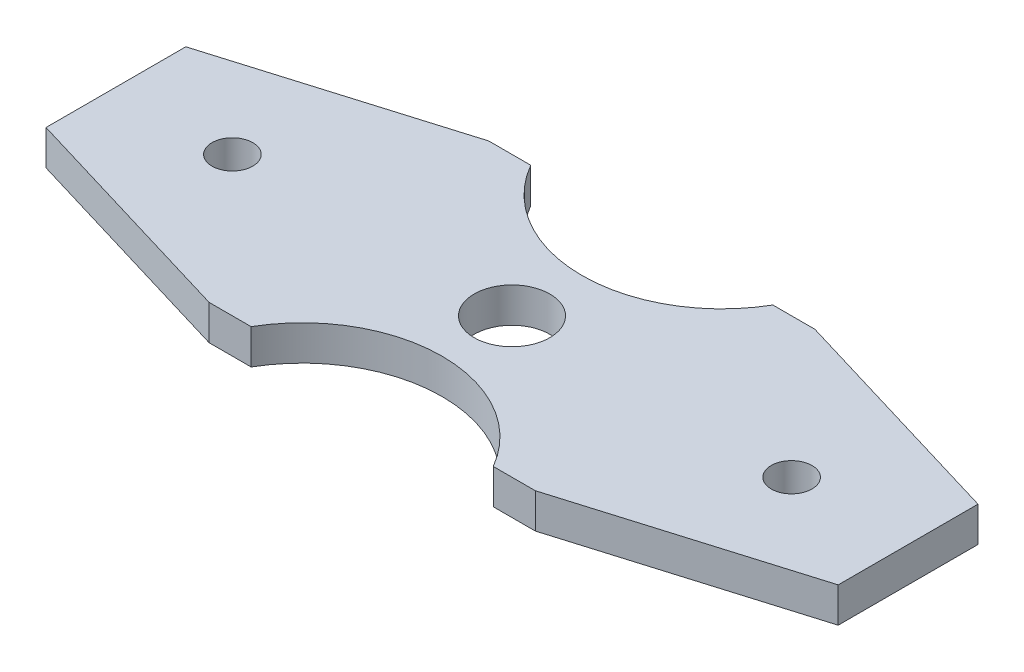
ISO-10303-21;
HEADER;
FILE_DESCRIPTION(('STEP AP214'),'2;1');
FILE_NAME('part.step','',(''),(''),'','','');
FILE_SCHEMA(('AUTOMOTIVE_DESIGN { 1 0 10303 214 1 1 1 1 }'));
ENDSEC;
DATA;
#1=APPLICATION_CONTEXT('core data for automotive mechanical design processes');
#2=APPLICATION_PROTOCOL_DEFINITION('international standard','automotive_design',2000,#1);
#3=PRODUCT_CONTEXT('',#1,'mechanical');
#4=PRODUCT('Part','Part','',(#3));
#5=PRODUCT_RELATED_PRODUCT_CATEGORY('part','',(#4));
#6=PRODUCT_DEFINITION_FORMATION('','',#4);
#7=PRODUCT_DEFINITION_CONTEXT('part definition',#1,'design');
#8=PRODUCT_DEFINITION('design','',#6,#7);
#9=PRODUCT_DEFINITION_SHAPE('','',#8);
#10=(LENGTH_UNIT() NAMED_UNIT(*) SI_UNIT(.MILLI.,.METRE.));
#11=(NAMED_UNIT(*) PLANE_ANGLE_UNIT() SI_UNIT($,.RADIAN.));
#12=(NAMED_UNIT(*) SI_UNIT($,.STERADIAN.) SOLID_ANGLE_UNIT());
#13=UNCERTAINTY_MEASURE_WITH_UNIT(LENGTH_MEASURE(1.E-05),#10,'distance_accuracy_value','');
#14=(GEOMETRIC_REPRESENTATION_CONTEXT(3) GLOBAL_UNCERTAINTY_ASSIGNED_CONTEXT((#13)) GLOBAL_UNIT_ASSIGNED_CONTEXT((#10,
#11,#12)) REPRESENTATION_CONTEXT('',''));
#15=CARTESIAN_POINT('',(0.,0.,0.));
#16=DIRECTION('',(0.,0.,1.));
#17=DIRECTION('',(1.,0.,0.));
#18=AXIS2_PLACEMENT_3D('',#15,#16,#17);
#19=CARTESIAN_POINT('',(34.,3.,5.99999999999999));
#20=DIRECTION('',(0.,1.,0.));
#21=DIRECTION('',(0.,0.,1.));
#22=AXIS2_PLACEMENT_3D('',#19,#20,#21);
#23=PLANE('',#22);
#24=CARTESIAN_POINT('',(10.,3.,-12.));
#25=DIRECTION('',(0.,1.,0.));
#26=DIRECTION('',(0.,0.,1.));
#27=AXIS2_PLACEMENT_3D('',#24,#25,#26);
#28=CIRCLE('',#27,1.75);
#29=CARTESIAN_POINT('',(10.,3.,-10.25));
#30=VERTEX_POINT('',#29);
#31=EDGE_CURVE('E303',#30,#30,#28,.T.);
#32=ORIENTED_EDGE('',*,*,#31,.F.);
#33=EDGE_LOOP('',(#32));
#34=FACE_BOUND('',#33,.T.);
#35=CARTESIAN_POINT('',(34.,3.,5.99999999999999));
#36=DIRECTION('',(0.,-1.,0.));
#37=DIRECTION('',(0.,0.,1.));
#38=AXIS2_PLACEMENT_3D('',#35,#36,#37);
#39=CIRCLE('',#38,12.);
#40=CARTESIAN_POINT('',(23.6076951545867,3.,0.));
#41=VERTEX_POINT('',#40);
#42=CARTESIAN_POINT('',(44.3923048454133,3.,0.));
#43=VERTEX_POINT('',#42);
#44=EDGE_CURVE('E168',#41,#43,#39,.T.);
#45=ORIENTED_EDGE('',*,*,#44,.T.);
#46=DIRECTION('',(1.,0.,0.));
#47=VECTOR('',#46,1.);
#48=CARTESIAN_POINT('',(44.3923048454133,3.,0.));
#49=LINE('',#48,#47);
#50=CARTESIAN_POINT('',(48.,3.,0.));
#51=VERTEX_POINT('',#50);
#52=EDGE_CURVE('E137',#43,#51,#49,.T.);
#53=ORIENTED_EDGE('',*,*,#52,.T.);
#54=DIRECTION('',(0.957826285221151,0.,-0.287347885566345));
#55=VECTOR('',#54,1.);
#56=CARTESIAN_POINT('',(68.,3.,-6.));
#57=LINE('',#56,#55);
#58=CARTESIAN_POINT('',(68.,3.,-6.));
#59=VERTEX_POINT('',#58);
#60=EDGE_CURVE('E171',#51,#59,#57,.T.);
#61=ORIENTED_EDGE('',*,*,#60,.T.);
#62=DIRECTION('',(0.,0.,-1.));
#63=VECTOR('',#62,1.);
#64=CARTESIAN_POINT('',(68.,3.,-6.));
#65=LINE('',#64,#63);
#66=CARTESIAN_POINT('',(68.,3.,-18.));
#67=VERTEX_POINT('',#66);
#68=EDGE_CURVE('E173',#59,#67,#65,.T.);
#69=ORIENTED_EDGE('',*,*,#68,.T.);
#70=DIRECTION('',(-0.957826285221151,0.,-0.287347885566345));
#71=VECTOR('',#70,1.);
#72=CARTESIAN_POINT('',(68.,3.,-18.));
#73=LINE('',#72,#71);
#74=CARTESIAN_POINT('',(48.,3.,-24.));
#75=VERTEX_POINT('',#74);
#76=EDGE_CURVE('E175',#67,#75,#73,.T.);
#77=ORIENTED_EDGE('',*,*,#76,.T.);
#78=DIRECTION('',(-1.,0.,0.));
#79=VECTOR('',#78,1.);
#80=CARTESIAN_POINT('',(44.3923048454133,3.,-24.));
#81=LINE('',#80,#79);
#82=CARTESIAN_POINT('',(44.3923048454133,3.,-24.));
#83=VERTEX_POINT('',#82);
#84=EDGE_CURVE('E177',#75,#83,#81,.T.);
#85=ORIENTED_EDGE('',*,*,#84,.T.);
#86=CARTESIAN_POINT('',(34.,3.,-30.));
#87=DIRECTION('',(0.,-1.,0.));
#88=DIRECTION('',(0.,0.,1.));
#89=AXIS2_PLACEMENT_3D('',#86,#87,#88);
#90=CIRCLE('',#89,12.);
#91=CARTESIAN_POINT('',(23.6076951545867,3.,-24.));
#92=VERTEX_POINT('',#91);
#93=EDGE_CURVE('E179',#83,#92,#90,.T.);
#94=ORIENTED_EDGE('',*,*,#93,.T.);
#95=DIRECTION('',(-1.,0.,0.));
#96=VECTOR('',#95,1.);
#97=CARTESIAN_POINT('',(20.,3.,-24.));
#98=LINE('',#97,#96);
#99=CARTESIAN_POINT('',(20.,3.,-24.));
#100=VERTEX_POINT('',#99);
#101=EDGE_CURVE('E181',#92,#100,#98,.T.);
#102=ORIENTED_EDGE('',*,*,#101,.T.);
#103=DIRECTION('',(-0.957826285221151,0.,0.287347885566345));
#104=VECTOR('',#103,1.);
#105=CARTESIAN_POINT('',(0.,3.,-18.));
#106=LINE('',#105,#104);
#107=CARTESIAN_POINT('',(0.,3.,-18.));
#108=VERTEX_POINT('',#107);
#109=EDGE_CURVE('E183',#100,#108,#106,.T.);
#110=ORIENTED_EDGE('',*,*,#109,.T.);
#111=DIRECTION('',(0.,0.,1.));
#112=VECTOR('',#111,1.);
#113=CARTESIAN_POINT('',(0.,3.,-6.));
#114=LINE('',#113,#112);
#115=CARTESIAN_POINT('',(0.,3.,-6.));
#116=VERTEX_POINT('',#115);
#117=EDGE_CURVE('E185',#108,#116,#114,.T.);
#118=ORIENTED_EDGE('',*,*,#117,.T.);
#119=DIRECTION('',(0.957826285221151,0.,0.287347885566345));
#120=VECTOR('',#119,1.);
#121=CARTESIAN_POINT('',(0.,3.,-6.));
#122=LINE('',#121,#120);
#123=CARTESIAN_POINT('',(20.,3.,0.));
#124=VERTEX_POINT('',#123);
#125=EDGE_CURVE('E54',#116,#124,#122,.T.);
#126=ORIENTED_EDGE('',*,*,#125,.T.);
#127=DIRECTION('',(1.,0.,0.));
#128=VECTOR('',#127,1.);
#129=CARTESIAN_POINT('',(20.,3.,0.));
#130=LINE('',#129,#128);
#131=EDGE_CURVE('E49',#124,#41,#130,.T.);
#132=ORIENTED_EDGE('',*,*,#131,.T.);
#133=EDGE_LOOP('',(#45,#53,#61,#69,#77,#85,#94,#102,#110,#118,#126,#132));
#134=FACE_BOUND('',#133,.T.);
#135=CARTESIAN_POINT('',(34.,3.,-12.));
#136=DIRECTION('',(0.,1.,0.));
#137=DIRECTION('',(0.,0.,1.));
#138=AXIS2_PLACEMENT_3D('',#135,#136,#137);
#139=CIRCLE('',#138,3.25);
#140=CARTESIAN_POINT('',(34.,3.,-8.75));
#141=VERTEX_POINT('',#140);
#142=EDGE_CURVE('E142',#141,#141,#139,.T.);
#143=ORIENTED_EDGE('',*,*,#142,.F.);
#144=EDGE_LOOP('',(#143));
#145=FACE_BOUND('',#144,.T.);
#146=CARTESIAN_POINT('',(58.,3.,-12.));
#147=DIRECTION('',(0.,1.,0.));
#148=DIRECTION('',(0.,0.,1.));
#149=AXIS2_PLACEMENT_3D('',#146,#147,#148);
#150=CIRCLE('',#149,1.75);
#151=CARTESIAN_POINT('',(58.,3.,-10.25));
#152=VERTEX_POINT('',#151);
#153=EDGE_CURVE('E292',#152,#152,#150,.T.);
#154=ORIENTED_EDGE('',*,*,#153,.F.);
#155=EDGE_LOOP('',(#154));
#156=FACE_BOUND('',#155,.T.);
#157=ADVANCED_FACE('F34',(#34,#134,#145,#156),#23,.T.);
#158=CARTESIAN_POINT('',(34.,0.,5.99999999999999));
#159=DIRECTION('',(0.,1.,0.));
#160=DIRECTION('',(0.,0.,1.));
#161=AXIS2_PLACEMENT_3D('',#158,#159,#160);
#162=PLANE('',#161);
#163=CARTESIAN_POINT('',(10.,0.,-12.));
#164=DIRECTION('',(0.,1.,0.));
#165=DIRECTION('',(0.,0.,1.));
#166=AXIS2_PLACEMENT_3D('',#163,#164,#165);
#167=CIRCLE('',#166,1.75);
#168=CARTESIAN_POINT('',(10.,0.,-10.25));
#169=VERTEX_POINT('',#168);
#170=EDGE_CURVE('E298',#169,#169,#167,.T.);
#171=ORIENTED_EDGE('',*,*,#170,.T.);
#172=EDGE_LOOP('',(#171));
#173=FACE_BOUND('',#172,.T.);
#174=CARTESIAN_POINT('',(34.,0.,5.99999999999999));
#175=DIRECTION('',(0.,-1.,0.));
#176=DIRECTION('',(0.,0.,1.));
#177=AXIS2_PLACEMENT_3D('',#174,#175,#176);
#178=CIRCLE('',#177,12.);
#179=CARTESIAN_POINT('',(23.6076951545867,0.,0.));
#180=VERTEX_POINT('',#179);
#181=CARTESIAN_POINT('',(44.3923048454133,0.,0.));
#182=VERTEX_POINT('',#181);
#183=EDGE_CURVE('E128',#180,#182,#178,.T.);
#184=ORIENTED_EDGE('',*,*,#183,.F.);
#185=DIRECTION('',(1.,0.,0.));
#186=VECTOR('',#185,1.);
#187=CARTESIAN_POINT('',(20.,0.,0.));
#188=LINE('',#187,#186);
#189=CARTESIAN_POINT('',(20.,0.,0.));
#190=VERTEX_POINT('',#189);
#191=EDGE_CURVE('E166',#190,#180,#188,.T.);
#192=ORIENTED_EDGE('',*,*,#191,.F.);
#193=DIRECTION('',(0.957826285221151,0.,0.287347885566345));
#194=VECTOR('',#193,1.);
#195=CARTESIAN_POINT('',(0.,0.,-6.));
#196=LINE('',#195,#194);
#197=CARTESIAN_POINT('',(0.,0.,-6.));
#198=VERTEX_POINT('',#197);
#199=EDGE_CURVE('E164',#198,#190,#196,.T.);
#200=ORIENTED_EDGE('',*,*,#199,.F.);
#201=DIRECTION('',(0.,0.,1.));
#202=VECTOR('',#201,1.);
#203=CARTESIAN_POINT('',(0.,0.,-6.));
#204=LINE('',#203,#202);
#205=CARTESIAN_POINT('',(0.,0.,-18.));
#206=VERTEX_POINT('',#205);
#207=EDGE_CURVE('E162',#206,#198,#204,.T.);
#208=ORIENTED_EDGE('',*,*,#207,.F.);
#209=DIRECTION('',(-0.957826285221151,0.,0.287347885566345));
#210=VECTOR('',#209,1.);
#211=CARTESIAN_POINT('',(0.,0.,-18.));
#212=LINE('',#211,#210);
#213=CARTESIAN_POINT('',(20.,0.,-24.));
#214=VERTEX_POINT('',#213);
#215=EDGE_CURVE('E160',#214,#206,#212,.T.);
#216=ORIENTED_EDGE('',*,*,#215,.F.);
#217=DIRECTION('',(-1.,0.,0.));
#218=VECTOR('',#217,1.);
#219=CARTESIAN_POINT('',(20.,0.,-24.));
#220=LINE('',#219,#218);
#221=CARTESIAN_POINT('',(23.6076951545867,0.,-24.));
#222=VERTEX_POINT('',#221);
#223=EDGE_CURVE('E158',#222,#214,#220,.T.);
#224=ORIENTED_EDGE('',*,*,#223,.F.);
#225=CARTESIAN_POINT('',(34.,0.,-30.));
#226=DIRECTION('',(0.,-1.,0.));
#227=DIRECTION('',(0.,0.,1.));
#228=AXIS2_PLACEMENT_3D('',#225,#226,#227);
#229=CIRCLE('',#228,12.);
#230=CARTESIAN_POINT('',(44.3923048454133,0.,-24.));
#231=VERTEX_POINT('',#230);
#232=EDGE_CURVE('E156',#231,#222,#229,.T.);
#233=ORIENTED_EDGE('',*,*,#232,.F.);
#234=DIRECTION('',(-1.,0.,0.));
#235=VECTOR('',#234,1.);
#236=CARTESIAN_POINT('',(44.3923048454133,0.,-24.));
#237=LINE('',#236,#235);
#238=CARTESIAN_POINT('',(48.,0.,-24.));
#239=VERTEX_POINT('',#238);
#240=EDGE_CURVE('E154',#239,#231,#237,.T.);
#241=ORIENTED_EDGE('',*,*,#240,.F.);
#242=DIRECTION('',(-0.957826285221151,0.,-0.287347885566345));
#243=VECTOR('',#242,1.);
#244=CARTESIAN_POINT('',(68.,0.,-18.));
#245=LINE('',#244,#243);
#246=CARTESIAN_POINT('',(68.,0.,-18.));
#247=VERTEX_POINT('',#246);
#248=EDGE_CURVE('E152',#247,#239,#245,.T.);
#249=ORIENTED_EDGE('',*,*,#248,.F.);
#250=DIRECTION('',(0.,0.,-1.));
#251=VECTOR('',#250,1.);
#252=CARTESIAN_POINT('',(68.,0.,-6.));
#253=LINE('',#252,#251);
#254=CARTESIAN_POINT('',(68.,0.,-6.));
#255=VERTEX_POINT('',#254);
#256=EDGE_CURVE('E150',#255,#247,#253,.T.);
#257=ORIENTED_EDGE('',*,*,#256,.F.);
#258=DIRECTION('',(0.957826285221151,0.,-0.287347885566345));
#259=VECTOR('',#258,1.);
#260=CARTESIAN_POINT('',(68.,0.,-6.));
#261=LINE('',#260,#259);
#262=CARTESIAN_POINT('',(48.,0.,0.));
#263=VERTEX_POINT('',#262);
#264=EDGE_CURVE('E130',#263,#255,#261,.T.);
#265=ORIENTED_EDGE('',*,*,#264,.F.);
#266=DIRECTION('',(1.,0.,0.));
#267=VECTOR('',#266,1.);
#268=CARTESIAN_POINT('',(44.3923048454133,0.,0.));
#269=LINE('',#268,#267);
#270=EDGE_CURVE('E123',#182,#263,#269,.T.);
#271=ORIENTED_EDGE('',*,*,#270,.F.);
#272=EDGE_LOOP('',(#184,#192,#200,#208,#216,#224,#233,#241,#249,#257,#265,#271));
#273=FACE_BOUND('',#272,.T.);
#274=CARTESIAN_POINT('',(34.,0.,-12.));
#275=DIRECTION('',(0.,1.,0.));
#276=DIRECTION('',(0.,0.,1.));
#277=AXIS2_PLACEMENT_3D('',#274,#275,#276);
#278=CIRCLE('',#277,3.25);
#279=CARTESIAN_POINT('',(34.,0.,-8.75));
#280=VERTEX_POINT('',#279);
#281=EDGE_CURVE('E145',#280,#280,#278,.T.);
#282=ORIENTED_EDGE('',*,*,#281,.T.);
#283=EDGE_LOOP('',(#282));
#284=FACE_BOUND('',#283,.T.);
#285=CARTESIAN_POINT('',(58.,0.,-12.));
#286=DIRECTION('',(0.,1.,0.));
#287=DIRECTION('',(0.,0.,1.));
#288=AXIS2_PLACEMENT_3D('',#285,#286,#287);
#289=CIRCLE('',#288,1.75);
#290=CARTESIAN_POINT('',(58.,0.,-10.25));
#291=VERTEX_POINT('',#290);
#292=EDGE_CURVE('E295',#291,#291,#289,.T.);
#293=ORIENTED_EDGE('',*,*,#292,.T.);
#294=EDGE_LOOP('',(#293));
#295=FACE_BOUND('',#294,.T.);
#296=ADVANCED_FACE('F124',(#173,#273,#284,#295),#162,.F.);
#297=CARTESIAN_POINT('',(34.,3.,5.99999999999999));
#298=DIRECTION('',(0.,-1.,0.));
#299=DIRECTION('',(0.,0.,-1.));
#300=AXIS2_PLACEMENT_3D('',#297,#298,#299);
#301=CYLINDRICAL_SURFACE('',#300,12.);
#302=ORIENTED_EDGE('',*,*,#183,.T.);
#303=DIRECTION('',(0.,-1.,0.));
#304=VECTOR('',#303,1.);
#305=CARTESIAN_POINT('',(44.3923048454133,3.,0.));
#306=LINE('',#305,#304);
#307=EDGE_CURVE('E11',#43,#182,#306,.T.);
#308=ORIENTED_EDGE('',*,*,#307,.F.);
#309=ORIENTED_EDGE('',*,*,#44,.F.);
#310=DIRECTION('',(0.,-1.,0.));
#311=VECTOR('',#310,1.);
#312=CARTESIAN_POINT('',(23.6076951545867,3.,0.));
#313=LINE('',#312,#311);
#314=EDGE_CURVE('E141',#41,#180,#313,.T.);
#315=ORIENTED_EDGE('',*,*,#314,.T.);
#316=EDGE_LOOP('',(#302,#308,#309,#315));
#317=FACE_BOUND('',#316,.T.);
#318=ADVANCED_FACE('F36',(#317),#301,.F.);
#319=CARTESIAN_POINT('',(44.3923048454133,3.,0.));
#320=DIRECTION('',(0.,0.,-1.));
#321=DIRECTION('',(-1.,0.,0.));
#322=AXIS2_PLACEMENT_3D('',#319,#320,#321);
#323=PLANE('',#322);
#324=ORIENTED_EDGE('',*,*,#270,.T.);
#325=DIRECTION('',(0.,-1.,0.));
#326=VECTOR('',#325,1.);
#327=CARTESIAN_POINT('',(48.,3.,0.));
#328=LINE('',#327,#326);
#329=EDGE_CURVE('E42',#51,#263,#328,.T.);
#330=ORIENTED_EDGE('',*,*,#329,.F.);
#331=ORIENTED_EDGE('',*,*,#52,.F.);
#332=ORIENTED_EDGE('',*,*,#307,.T.);
#333=EDGE_LOOP('',(#324,#330,#331,#332));
#334=FACE_BOUND('',#333,.T.);
#335=ADVANCED_FACE('F136',(#334),#323,.F.);
#336=CARTESIAN_POINT('',(68.,3.,-6.));
#337=DIRECTION('',(-0.287347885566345,0.,-0.957826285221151));
#338=DIRECTION('',(-0.957826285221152,0.,0.287347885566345));
#339=AXIS2_PLACEMENT_3D('',#336,#337,#338);
#340=PLANE('',#339);
#341=ORIENTED_EDGE('',*,*,#264,.T.);
#342=DIRECTION('',(0.,-1.,0.));
#343=VECTOR('',#342,1.);
#344=CARTESIAN_POINT('',(68.,3.,-6.));
#345=LINE('',#344,#343);
#346=EDGE_CURVE('E214',#59,#255,#345,.T.);
#347=ORIENTED_EDGE('',*,*,#346,.F.);
#348=ORIENTED_EDGE('',*,*,#60,.F.);
#349=ORIENTED_EDGE('',*,*,#329,.T.);
#350=EDGE_LOOP('',(#341,#347,#348,#349));
#351=FACE_BOUND('',#350,.T.);
#352=ADVANCED_FACE('F218',(#351),#340,.F.);
#353=CARTESIAN_POINT('',(68.,3.,-6.));
#354=DIRECTION('',(-1.,0.,0.));
#355=DIRECTION('',(0.,0.,1.));
#356=AXIS2_PLACEMENT_3D('',#353,#354,#355);
#357=PLANE('',#356);
#358=ORIENTED_EDGE('',*,*,#256,.T.);
#359=DIRECTION('',(0.,-1.,0.));
#360=VECTOR('',#359,1.);
#361=CARTESIAN_POINT('',(68.,3.,-18.));
#362=LINE('',#361,#360);
#363=EDGE_CURVE('E211',#67,#247,#362,.T.);
#364=ORIENTED_EDGE('',*,*,#363,.F.);
#365=ORIENTED_EDGE('',*,*,#68,.F.);
#366=ORIENTED_EDGE('',*,*,#346,.T.);
#367=EDGE_LOOP('',(#358,#364,#365,#366));
#368=FACE_BOUND('',#367,.T.);
#369=ADVANCED_FACE('F226',(#368),#357,.F.);
#370=CARTESIAN_POINT('',(68.,3.,-18.));
#371=DIRECTION('',(-0.287347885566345,0.,0.957826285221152));
#372=DIRECTION('',(0.957826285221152,0.,0.287347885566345));
#373=AXIS2_PLACEMENT_3D('',#370,#371,#372);
#374=PLANE('',#373);
#375=ORIENTED_EDGE('',*,*,#248,.T.);
#376=DIRECTION('',(0.,-1.,0.));
#377=VECTOR('',#376,1.);
#378=CARTESIAN_POINT('',(48.,3.,-24.));
#379=LINE('',#378,#377);
#380=EDGE_CURVE('E208',#75,#239,#379,.T.);
#381=ORIENTED_EDGE('',*,*,#380,.F.);
#382=ORIENTED_EDGE('',*,*,#76,.F.);
#383=ORIENTED_EDGE('',*,*,#363,.T.);
#384=EDGE_LOOP('',(#375,#381,#382,#383));
#385=FACE_BOUND('',#384,.T.);
#386=ADVANCED_FACE('F229',(#385),#374,.F.);
#387=CARTESIAN_POINT('',(44.3923048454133,3.,-24.));
#388=DIRECTION('',(0.,0.,1.));
#389=DIRECTION('',(1.,0.,0.));
#390=AXIS2_PLACEMENT_3D('',#387,#388,#389);
#391=PLANE('',#390);
#392=ORIENTED_EDGE('',*,*,#240,.T.);
#393=DIRECTION('',(0.,-1.,0.));
#394=VECTOR('',#393,1.);
#395=CARTESIAN_POINT('',(44.3923048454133,3.,-24.));
#396=LINE('',#395,#394);
#397=EDGE_CURVE('E205',#83,#231,#396,.T.);
#398=ORIENTED_EDGE('',*,*,#397,.F.);
#399=ORIENTED_EDGE('',*,*,#84,.F.);
#400=ORIENTED_EDGE('',*,*,#380,.T.);
#401=EDGE_LOOP('',(#392,#398,#399,#400));
#402=FACE_BOUND('',#401,.T.);
#403=ADVANCED_FACE('F234',(#402),#391,.F.);
#404=CARTESIAN_POINT('',(34.,3.,-30.));
#405=DIRECTION('',(0.,-1.,0.));
#406=DIRECTION('',(0.,0.,-1.));
#407=AXIS2_PLACEMENT_3D('',#404,#405,#406);
#408=CYLINDRICAL_SURFACE('',#407,12.);
#409=ORIENTED_EDGE('',*,*,#232,.T.);
#410=DIRECTION('',(0.,-1.,0.));
#411=VECTOR('',#410,1.);
#412=CARTESIAN_POINT('',(23.6076951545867,3.,-24.));
#413=LINE('',#412,#411);
#414=EDGE_CURVE('E202',#92,#222,#413,.T.);
#415=ORIENTED_EDGE('',*,*,#414,.F.);
#416=ORIENTED_EDGE('',*,*,#93,.F.);
#417=ORIENTED_EDGE('',*,*,#397,.T.);
#418=EDGE_LOOP('',(#409,#415,#416,#417));
#419=FACE_BOUND('',#418,.T.);
#420=ADVANCED_FACE('F240',(#419),#408,.F.);
#421=CARTESIAN_POINT('',(20.,3.,-24.));
#422=DIRECTION('',(0.,0.,1.));
#423=DIRECTION('',(1.,0.,0.));
#424=AXIS2_PLACEMENT_3D('',#421,#422,#423);
#425=PLANE('',#424);
#426=ORIENTED_EDGE('',*,*,#223,.T.);
#427=DIRECTION('',(0.,-1.,0.));
#428=VECTOR('',#427,1.);
#429=CARTESIAN_POINT('',(20.,3.,-24.));
#430=LINE('',#429,#428);
#431=EDGE_CURVE('E199',#100,#214,#430,.T.);
#432=ORIENTED_EDGE('',*,*,#431,.F.);
#433=ORIENTED_EDGE('',*,*,#101,.F.);
#434=ORIENTED_EDGE('',*,*,#414,.T.);
#435=EDGE_LOOP('',(#426,#432,#433,#434));
#436=FACE_BOUND('',#435,.T.);
#437=ADVANCED_FACE('F244',(#436),#425,.F.);
#438=CARTESIAN_POINT('',(0.,3.,-18.));
#439=DIRECTION('',(0.287347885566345,0.,0.957826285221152));
#440=DIRECTION('',(0.957826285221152,0.,-0.287347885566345));
#441=AXIS2_PLACEMENT_3D('',#438,#439,#440);
#442=PLANE('',#441);
#443=ORIENTED_EDGE('',*,*,#215,.T.);
#444=DIRECTION('',(0.,-1.,0.));
#445=VECTOR('',#444,1.);
#446=CARTESIAN_POINT('',(0.,3.,-18.));
#447=LINE('',#446,#445);
#448=EDGE_CURVE('E196',#108,#206,#447,.T.);
#449=ORIENTED_EDGE('',*,*,#448,.F.);
#450=ORIENTED_EDGE('',*,*,#109,.F.);
#451=ORIENTED_EDGE('',*,*,#431,.T.);
#452=EDGE_LOOP('',(#443,#449,#450,#451));
#453=FACE_BOUND('',#452,.T.);
#454=ADVANCED_FACE('F249',(#453),#442,.F.);
#455=CARTESIAN_POINT('',(0.,3.,-6.));
#456=DIRECTION('',(1.,0.,0.));
#457=DIRECTION('',(0.,0.,-1.));
#458=AXIS2_PLACEMENT_3D('',#455,#456,#457);
#459=PLANE('',#458);
#460=ORIENTED_EDGE('',*,*,#207,.T.);
#461=DIRECTION('',(0.,-1.,0.));
#462=VECTOR('',#461,1.);
#463=CARTESIAN_POINT('',(0.,3.,-6.));
#464=LINE('',#463,#462);
#465=EDGE_CURVE('E193',#116,#198,#464,.T.);
#466=ORIENTED_EDGE('',*,*,#465,.F.);
#467=ORIENTED_EDGE('',*,*,#117,.F.);
#468=ORIENTED_EDGE('',*,*,#448,.T.);
#469=EDGE_LOOP('',(#460,#466,#467,#468));
#470=FACE_BOUND('',#469,.T.);
#471=ADVANCED_FACE('F253',(#470),#459,.F.);
#472=CARTESIAN_POINT('',(0.,3.,-6.));
#473=DIRECTION('',(0.287347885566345,0.,-0.957826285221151));
#474=DIRECTION('',(-0.957826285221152,0.,-0.287347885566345));
#475=AXIS2_PLACEMENT_3D('',#472,#473,#474);
#476=PLANE('',#475);
#477=ORIENTED_EDGE('',*,*,#199,.T.);
#478=DIRECTION('',(0.,-1.,0.));
#479=VECTOR('',#478,1.);
#480=CARTESIAN_POINT('',(20.,3.,0.));
#481=LINE('',#480,#479);
#482=EDGE_CURVE('E190',#124,#190,#481,.T.);
#483=ORIENTED_EDGE('',*,*,#482,.F.);
#484=ORIENTED_EDGE('',*,*,#125,.F.);
#485=ORIENTED_EDGE('',*,*,#465,.T.);
#486=EDGE_LOOP('',(#477,#483,#484,#485));
#487=FACE_BOUND('',#486,.T.);
#488=ADVANCED_FACE('F257',(#487),#476,.F.);
#489=CARTESIAN_POINT('',(20.,3.,0.));
#490=DIRECTION('',(0.,0.,-1.));
#491=DIRECTION('',(-1.,0.,0.));
#492=AXIS2_PLACEMENT_3D('',#489,#490,#491);
#493=PLANE('',#492);
#494=ORIENTED_EDGE('',*,*,#191,.T.);
#495=ORIENTED_EDGE('',*,*,#314,.F.);
#496=ORIENTED_EDGE('',*,*,#131,.F.);
#497=ORIENTED_EDGE('',*,*,#482,.T.);
#498=EDGE_LOOP('',(#494,#495,#496,#497));
#499=FACE_BOUND('',#498,.T.);
#500=ADVANCED_FACE('F259',(#499),#493,.F.);
#501=CARTESIAN_POINT('',(34.,3.,-12.));
#502=DIRECTION('',(0.,-1.,0.));
#503=DIRECTION('',(0.,0.,-1.));
#504=AXIS2_PLACEMENT_3D('',#501,#502,#503);
#505=CYLINDRICAL_SURFACE('',#504,3.25);
#506=ORIENTED_EDGE('',*,*,#142,.T.);
#507=EDGE_LOOP('',(#506));
#508=FACE_BOUND('',#507,.T.);
#509=ORIENTED_EDGE('',*,*,#281,.F.);
#510=EDGE_LOOP('',(#509));
#511=FACE_BOUND('',#510,.T.);
#512=ADVANCED_FACE('F261',(#508,#511),#505,.F.);
#513=CARTESIAN_POINT('',(10.,3.,-12.));
#514=DIRECTION('',(0.,-1.,0.));
#515=DIRECTION('',(0.,0.,-1.));
#516=AXIS2_PLACEMENT_3D('',#513,#514,#515);
#517=CYLINDRICAL_SURFACE('',#516,1.75);
#518=ORIENTED_EDGE('',*,*,#31,.T.);
#519=EDGE_LOOP('',(#518));
#520=FACE_BOUND('',#519,.T.);
#521=ORIENTED_EDGE('',*,*,#170,.F.);
#522=EDGE_LOOP('',(#521));
#523=FACE_BOUND('',#522,.T.);
#524=ADVANCED_FACE('F267',(#520,#523),#517,.F.);
#525=CARTESIAN_POINT('',(58.,3.,-12.));
#526=DIRECTION('',(0.,-1.,0.));
#527=DIRECTION('',(0.,0.,-1.));
#528=AXIS2_PLACEMENT_3D('',#525,#526,#527);
#529=CYLINDRICAL_SURFACE('',#528,1.75);
#530=ORIENTED_EDGE('',*,*,#153,.T.);
#531=EDGE_LOOP('',(#530));
#532=FACE_BOUND('',#531,.T.);
#533=ORIENTED_EDGE('',*,*,#292,.F.);
#534=EDGE_LOOP('',(#533));
#535=FACE_BOUND('',#534,.T.);
#536=ADVANCED_FACE('F283',(#532,#535),#529,.F.);
#537=CLOSED_SHELL('',(#157,#296,#318,#335,#352,#369,#386,#403,#420,#437,#454,#471,#488,#500,
#512,#524,#536));
#538=MANIFOLD_SOLID_BREP('B2',#537);
#539=ADVANCED_BREP_SHAPE_REPRESENTATION('',(#18,#538),#14);
#540=SHAPE_DEFINITION_REPRESENTATION(#9,#539);
ENDSEC;
END-ISO-10303-21;
